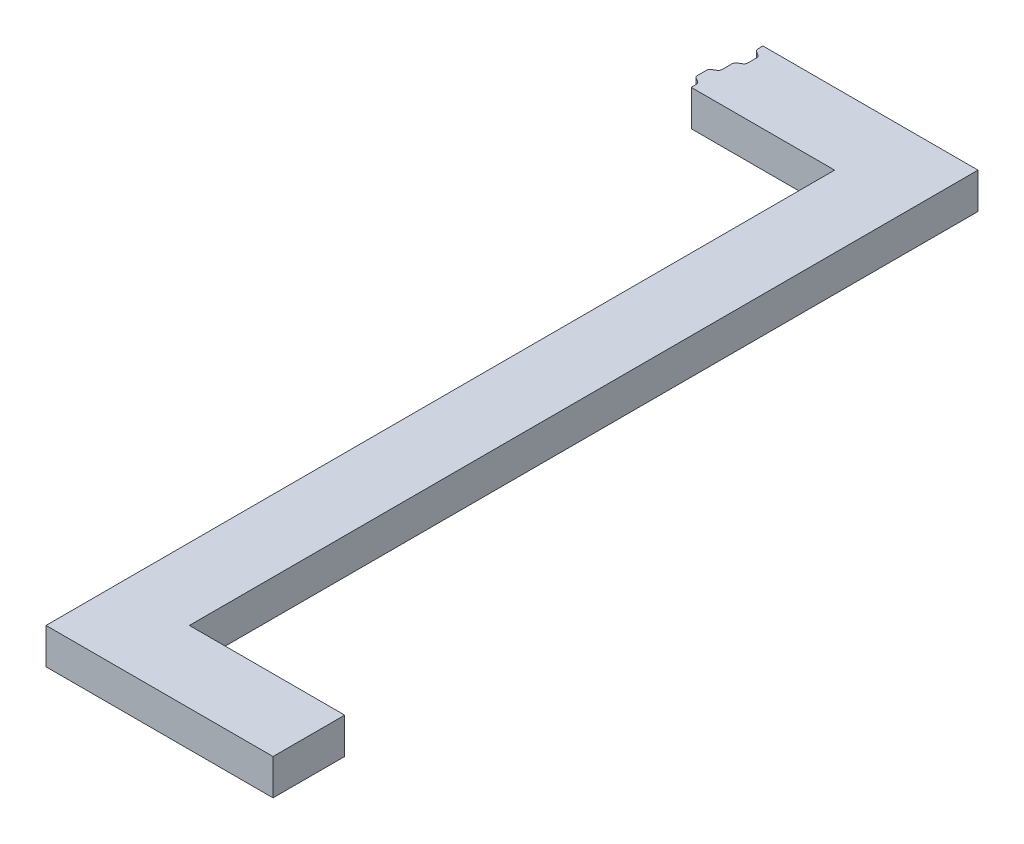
from build123d import *

# Parameters (mm, degrees)
EXTRUSION1_DEPTH = 15


with BuildPart() as part:
    # Esquisse1 → Extrusion1 (new body)
    with BuildSketch(Plane(origin=(0, 0, 0), x_dir=(1, 0, 0), z_dir=(0, 1, 0))):
        with BuildLine():
            Line((90, 30), (90, -300))
            Line((90, -300), (155, -300))
            Line((155, -300), (155, -330))
            Line((155, -330), (60, -330))
            Line((60, -330), (60, 0))
            Line((60, 0), (0.2, 0))
            ThreePointArc((0.2, 0), (0.058578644, 0.058578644), (0, 0.2))
            Line((0, 0.2), (0, 2.076239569))
            ThreePointArc((0, 2.076239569), (-0.214359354, 2.876239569), (-0.8, 3.461880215))
            Line((-0.8, 3.461880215), (-2.2, 4.270170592))
            ThreePointArc((-2.2, 4.270170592), (-2.785640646, 4.855811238), (-3, 5.655811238))
            Line((-3, 5.655811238), (-3, 9.339621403))
            ThreePointArc((-3, 9.339621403), (-2.786262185, 10.1385439), (-2.202153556, 10.72401646))
            Line((-2.202153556, 10.72401646), (-0.797846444, 11.537707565))
            ThreePointArc((-0.797846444, 11.537707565), (-0.213737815, 12.123180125), (0, 12.922102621))
            Line((0, 12.922102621), (0, 17.077897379))
            ThreePointArc((0, 17.077897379), (0.213737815, 17.876819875), (0.797846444, 18.462292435))
            Line((0.797846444, 18.462292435), (2.202153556, 19.27598354))
            ThreePointArc((2.202153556, 19.27598354), (2.786262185, 19.8614561), (3, 20.660378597))
            Line((3, 20.660378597), (3, 24.344188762))
            ThreePointArc((3, 24.344188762), (2.785640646, 25.144188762), (2.2, 25.729829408))
            Line((2.2, 25.729829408), (0.8, 26.538119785))
            ThreePointArc((0.8, 26.538119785), (0.214359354, 27.123760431), (0, 27.923760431))
            Line((0, 27.923760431), (0, 29.8))
            ThreePointArc((0, 29.8), (0.058578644, 29.941421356), (0.2, 30))
            Line((0.2, 30), (90, 30))
        make_face()
    extrude(amount=EXTRUSION1_DEPTH)


solid = part.part
